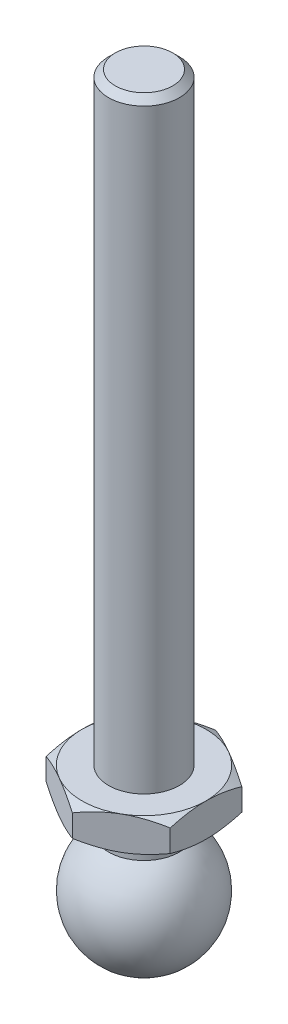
ISO-10303-21;
HEADER;
FILE_DESCRIPTION(('STEP AP214'),'2;1');
FILE_NAME('part.step','',(''),(''),'','','');
FILE_SCHEMA(('AUTOMOTIVE_DESIGN { 1 0 10303 214 1 1 1 1 }'));
ENDSEC;
DATA;
#1=APPLICATION_CONTEXT('core data for automotive mechanical design processes');
#2=APPLICATION_PROTOCOL_DEFINITION('international standard','automotive_design',2000,#1);
#3=PRODUCT_CONTEXT('',#1,'mechanical');
#4=PRODUCT('Part','Part','',(#3));
#5=PRODUCT_RELATED_PRODUCT_CATEGORY('part','',(#4));
#6=PRODUCT_DEFINITION_FORMATION('','',#4);
#7=PRODUCT_DEFINITION_CONTEXT('part definition',#1,'design');
#8=PRODUCT_DEFINITION('design','',#6,#7);
#9=PRODUCT_DEFINITION_SHAPE('','',#8);
#10=(LENGTH_UNIT() NAMED_UNIT(*) SI_UNIT(.MILLI.,.METRE.));
#11=(NAMED_UNIT(*) PLANE_ANGLE_UNIT() SI_UNIT($,.RADIAN.));
#12=(NAMED_UNIT(*) SI_UNIT($,.STERADIAN.) SOLID_ANGLE_UNIT());
#13=UNCERTAINTY_MEASURE_WITH_UNIT(LENGTH_MEASURE(1.E-05),#10,'distance_accuracy_value','');
#14=(GEOMETRIC_REPRESENTATION_CONTEXT(3) GLOBAL_UNCERTAINTY_ASSIGNED_CONTEXT((#13)) GLOBAL_UNIT_ASSIGNED_CONTEXT((#10,
#11,#12)) REPRESENTATION_CONTEXT('',''));
#15=CARTESIAN_POINT('',(0.,0.,0.));
#16=DIRECTION('',(0.,0.,1.));
#17=DIRECTION('',(1.,0.,0.));
#18=AXIS2_PLACEMENT_3D('',#15,#16,#17);
#19=CARTESIAN_POINT('',(0.,12.25,0.));
#20=DIRECTION('',(0.,-1.,0.));
#21=DIRECTION('',(0.,0.,-1.));
#22=AXIS2_PLACEMENT_3D('',#19,#20,#21);
#23=CONICAL_SURFACE('',#22,7.,1.0471975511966);
#24=CARTESIAN_POINT('',(-7.,8.18828268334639,12.1648696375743));
#25=CARTESIAN_POINT('',(-7.,8.33391573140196,11.8738003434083));
#26=CARTESIAN_POINT('',(-7.,8.47854589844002,11.5822239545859));
#27=CARTESIAN_POINT('',(-7.,8.76531569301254,10.997825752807));
#28=CARTESIAN_POINT('',(-7.,8.90745515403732,10.7050038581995));
#29=CARTESIAN_POINT('',(-7.,9.18902214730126,10.117331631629));
#30=CARTESIAN_POINT('',(-7.,9.32844364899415,9.82247840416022));
#31=CARTESIAN_POINT('',(-7.,9.60360604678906,9.23106328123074));
#32=CARTESIAN_POINT('',(-7.,9.73934701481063,8.93450141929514));
#33=CARTESIAN_POINT('',(-7.,10.0123110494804,8.32593520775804));
#34=CARTESIAN_POINT('',(-7.,10.149325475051,8.01383696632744));
#35=CARTESIAN_POINT('',(-7.,10.4171383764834,7.38695797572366));
#36=CARTESIAN_POINT('',(-7.,10.5479365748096,7.07217710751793));
#37=CARTESIAN_POINT('',(-7.,10.8015530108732,6.43962449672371));
#38=CARTESIAN_POINT('',(-7.,10.924376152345,6.1218547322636));
#39=CARTESIAN_POINT('',(-7.,11.1599016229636,5.48260317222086));
#40=CARTESIAN_POINT('',(-7.,11.2726050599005,5.1611217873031));
#41=CARTESIAN_POINT('',(-7.,11.5099014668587,4.4382173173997));
#42=CARTESIAN_POINT('',(-7.,11.6311181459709,4.03566892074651));
#43=CARTESIAN_POINT('',(-7.,11.8469740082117,3.22331060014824));
#44=CARTESIAN_POINT('',(-7.,11.9416155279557,2.81350131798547));
#45=CARTESIAN_POINT('',(-7.,12.0569999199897,2.19742561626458));
#46=CARTESIAN_POINT('',(-7.,12.0908518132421,1.99359214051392));
#47=CARTESIAN_POINT('',(-7.,12.1493191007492,1.5846161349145));
#48=CARTESIAN_POINT('',(-7.,12.1739358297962,1.37947379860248));
#49=CARTESIAN_POINT('',(-7.,12.2131968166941,0.968289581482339));
#50=CARTESIAN_POINT('',(-7.,12.2278439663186,0.762247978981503));
#51=CARTESIAN_POINT('',(-7.,12.2467021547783,0.349683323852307));
#52=CARTESIAN_POINT('',(-7.,12.2509132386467,0.143160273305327));
#53=CARTESIAN_POINT('',(-7.,12.2487493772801,-0.271082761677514));
#54=CARTESIAN_POINT('',(-7.,12.2423100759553,-0.478802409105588));
#55=CARTESIAN_POINT('',(-7.,12.2189433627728,-0.893645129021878));
#56=CARTESIAN_POINT('',(-7.,12.2020159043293,-1.10076819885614));
#57=CARTESIAN_POINT('',(-7.,12.1582124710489,-1.51403043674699));
#58=CARTESIAN_POINT('',(-7.,12.1313327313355,-1.72016920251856));
#59=CARTESIAN_POINT('',(-7.,12.0684180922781,-2.13103319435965));
#60=CARTESIAN_POINT('',(-7.,12.0323828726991,-2.33575837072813));
#61=CARTESIAN_POINT('',(-7.,11.9105686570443,-2.95437912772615));
#62=CARTESIAN_POINT('',(-7.,11.8118729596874,-3.36575077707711));
#63=CARTESIAN_POINT('',(-7.,11.5884533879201,-4.18138012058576));
#64=CARTESIAN_POINT('',(-7.,11.4637148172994,-4.58563365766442));
#65=CARTESIAN_POINT('',(-7.,11.2233248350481,-5.3032089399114));
#66=CARTESIAN_POINT('',(-7.,11.1112875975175,-5.61775957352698));
#67=CARTESIAN_POINT('',(-7.,10.8778514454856,-6.2432502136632));
#68=CARTESIAN_POINT('',(-7.,10.7564551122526,-6.55419118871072));
#69=CARTESIAN_POINT('',(-7.,10.5062070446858,-7.17328528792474));
#70=CARTESIAN_POINT('',(-7.,10.3773503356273,-7.48143638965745));
#71=CARTESIAN_POINT('',(-7.,10.1137823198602,-8.09523802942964));
#72=CARTESIAN_POINT('',(-7.,9.97907065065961,-8.40088841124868));
#73=CARTESIAN_POINT('',(-7.,9.71078407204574,-8.99716345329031));
#74=CARTESIAN_POINT('',(-7.,9.57740317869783,-9.28787568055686));
#75=CARTESIAN_POINT('',(-7.,9.30714715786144,-9.86766295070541));
#76=CARTESIAN_POINT('',(-7.,9.17027208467,-10.1567380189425));
#77=CARTESIAN_POINT('',(-7.,8.89389786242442,-10.7329937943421));
#78=CARTESIAN_POINT('',(-7.,8.75440383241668,-11.0201769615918));
#79=CARTESIAN_POINT('',(-7.,8.47302286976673,-11.5933594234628));
#80=CARTESIAN_POINT('',(-7.,8.3311360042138,-11.879358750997));
#81=CARTESIAN_POINT('',(-7.,8.18828268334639,-12.1648696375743));
#82=B_SPLINE_CURVE_WITH_KNOTS('',3,(#24,#25,#26,#27,#28,#29,#30,#31,#32,#33,#34,#35,#36,#37,#38,
#39,#40,#41,#42,#43,#44,#45,#46,#47,#48,#49,#50,#51,#52,#53,#54,#55,#56,#57,#58,#59,#60,#61,#62,
#63,#64,#65,#66,#67,#68,#69,#70,#71,#72,#73,#74,#75,#76,#77,#78,#79,#80,#81),.UNSPECIFIED.,.F.,
.F.,(4,2,2,2,2,2,2,2,2,2,2,2,2,2,2,2,2,2,2,2,2,2,2,2,2,2,2,2,4),(0.,0.976413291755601,
1.95289161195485,2.93133423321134,3.90975772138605,4.93225217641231,5.95479223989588,
6.97669748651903,7.99849072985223,9.25906449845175,10.5195273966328,11.1392271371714,
11.7588372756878,12.3782676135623,12.9976952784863,13.6208795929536,14.2440666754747,
14.8674897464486,15.4909346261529,16.7587972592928,18.0273773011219,19.0289263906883,
20.0302002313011,21.0321496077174,22.0341611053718,22.9936838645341,23.9531917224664,
24.9109871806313,25.8687558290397),.UNSPECIFIED.);
#83=CARTESIAN_POINT('',(-7.,11.6247852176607,4.04145188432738));
#84=VERTEX_POINT('',#83);
#85=CARTESIAN_POINT('',(-7.,12.25,0.));
#86=VERTEX_POINT('',#85);
#87=EDGE_CURVE('E309',#84,#86,#82,.T.);
#88=ORIENTED_EDGE('',*,*,#87,.F.);
#89=CARTESIAN_POINT('',(0.0002,11.6247185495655,8.0830192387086));
#90=CARTESIAN_POINT('',(-0.153667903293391,11.6760001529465,7.99418356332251));
#91=CARTESIAN_POINT('',(-0.308109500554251,11.7249544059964,7.90501666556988));
#92=CARTESIAN_POINT('',(-0.618246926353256,11.8175672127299,7.72595873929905));
#93=CARTESIAN_POINT('',(-0.773943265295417,11.8612234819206,7.63606741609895));
#94=CARTESIAN_POINT('',(-1.24352516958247,11.9833884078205,7.36495417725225));
#95=CARTESIAN_POINT('',(-1.5592643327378,12.052874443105,7.18266208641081));
#96=CARTESIAN_POINT('',(-2.03176224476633,12.1343550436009,6.9098652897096));
#97=CARTESIAN_POINT('',(-2.18710922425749,12.1575665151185,6.82017566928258));
#98=CARTESIAN_POINT('',(-2.49850511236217,12.1964887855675,6.64039116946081));
#99=CARTESIAN_POINT('',(-2.65455395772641,12.2122002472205,6.55029632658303));
#100=CARTESIAN_POINT('',(-2.96692267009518,12.2357220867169,6.3699501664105));
#101=CARTESIAN_POINT('',(-3.12324202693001,12.2435414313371,6.27969914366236));
#102=CARTESIAN_POINT('',(-3.43601650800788,12.2511197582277,6.09911871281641));
#103=CARTESIAN_POINT('',(-3.59247162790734,12.250878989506,6.00878930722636));
#104=CARTESIAN_POINT('',(-4.02110687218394,12.2391402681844,5.76131663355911));
#105=CARTESIAN_POINT('',(-4.2931466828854,12.2194342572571,5.60425437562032));
#106=CARTESIAN_POINT('',(-4.8354194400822,12.1569465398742,5.29117305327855));
#107=CARTESIAN_POINT('',(-5.10565047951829,12.114143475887,5.13515508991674));
#108=CARTESIAN_POINT('',(-5.64901454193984,12.0071483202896,4.82144370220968));
#109=CARTESIAN_POINT('',(-5.92207900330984,11.9425029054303,4.66378986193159));
#110=CARTESIAN_POINT('',(-6.46413578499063,11.795783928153,4.35083323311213));
#111=CARTESIAN_POINT('',(-6.73313504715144,11.7137448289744,4.19552643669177));
#112=CARTESIAN_POINT('',(-7.0002,11.6247185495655,4.04133641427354));
#113=B_SPLINE_CURVE_WITH_KNOTS('',3,(#89,#90,#91,#92,#93,#94,#95,#96,#97,#98,#99,#100,#101,#102,
#103,#104,#105,#106,#107,#108,#109,#110,#111,#112),.UNSPECIFIED.,.F.,.F.,(4,2,2,2,2,2,2,2,2,2,2,
4),(0.,0.554727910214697,1.10969417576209,2.2219327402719,2.76443041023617,3.30688013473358,
3.84871284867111,4.3905288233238,5.33376515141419,6.27787517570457,7.2429241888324,
8.20607866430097),.UNSPECIFIED.);
#114=CARTESIAN_POINT('',(-3.5,12.25,6.06217782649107));
#115=VERTEX_POINT('',#114);
#116=EDGE_CURVE('E135',#115,#84,#113,.T.);
#117=ORIENTED_EDGE('',*,*,#116,.F.);
#118=CARTESIAN_POINT('',(0.,12.25,0.));
#119=DIRECTION('',(0.,-1.,0.));
#120=DIRECTION('',(0.,0.,-1.));
#121=AXIS2_PLACEMENT_3D('',#118,#119,#120);
#122=CIRCLE('',#121,7.);
#123=EDGE_CURVE('E283',#115,#86,#122,.T.);
#124=ORIENTED_EDGE('',*,*,#123,.T.);
#125=EDGE_LOOP('',(#88,#117,#124));
#126=FACE_BOUND('',#125,.T.);
#127=ADVANCED_FACE('F14',(#126),#23,.T.);
#128=CARTESIAN_POINT('',(-7.,11.6247852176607,-4.04145188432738));
#129=VERTEX_POINT('',#128);
#130=EDGE_CURVE('E193',#86,#129,#82,.T.);
#131=ORIENTED_EDGE('',*,*,#130,.F.);
#132=CARTESIAN_POINT('',(-3.5,12.25,-6.06217782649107));
#133=VERTEX_POINT('',#132);
#134=EDGE_CURVE('E195',#86,#133,#122,.T.);
#135=ORIENTED_EDGE('',*,*,#134,.T.);
#136=CARTESIAN_POINT('',(-7.0002,11.6247185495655,-4.04133641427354));
#137=CARTESIAN_POINT('',(-6.84633209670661,11.6760001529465,-4.13017208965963));
#138=CARTESIAN_POINT('',(-6.69189049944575,11.7249544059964,-4.21933898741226));
#139=CARTESIAN_POINT('',(-6.38175307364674,11.8175672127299,-4.39839691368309));
#140=CARTESIAN_POINT('',(-6.22605673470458,11.8612234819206,-4.48828823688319));
#141=CARTESIAN_POINT('',(-5.75647483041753,11.9833884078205,-4.75940147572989));
#142=CARTESIAN_POINT('',(-5.44073566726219,12.052874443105,-4.94169356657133));
#143=CARTESIAN_POINT('',(-4.96823775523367,12.1343550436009,-5.21449036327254));
#144=CARTESIAN_POINT('',(-4.81289077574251,12.1575665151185,-5.30417998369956));
#145=CARTESIAN_POINT('',(-4.50149488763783,12.1964887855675,-5.48396448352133));
#146=CARTESIAN_POINT('',(-4.34544604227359,12.2122002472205,-5.57405932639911));
#147=CARTESIAN_POINT('',(-4.03307732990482,12.2357220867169,-5.75440548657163));
#148=CARTESIAN_POINT('',(-3.87675797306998,12.2435414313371,-5.84465650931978));
#149=CARTESIAN_POINT('',(-3.56398349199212,12.2511197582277,-6.02523694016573));
#150=CARTESIAN_POINT('',(-3.40752837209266,12.250878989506,-6.11556634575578));
#151=CARTESIAN_POINT('',(-2.97889312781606,12.2391402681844,-6.36303901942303));
#152=CARTESIAN_POINT('',(-2.70685331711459,12.2194342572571,-6.52010127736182));
#153=CARTESIAN_POINT('',(-2.1645805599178,12.1569465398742,-6.83318259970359));
#154=CARTESIAN_POINT('',(-1.89434952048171,12.114143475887,-6.9892005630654));
#155=CARTESIAN_POINT('',(-1.35098545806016,12.0071483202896,-7.30291195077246));
#156=CARTESIAN_POINT('',(-1.07792099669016,11.9425029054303,-7.46056579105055));
#157=CARTESIAN_POINT('',(-0.535864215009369,11.795783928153,-7.77352241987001));
#158=CARTESIAN_POINT('',(-0.266864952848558,11.7137448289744,-7.92882921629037));
#159=CARTESIAN_POINT('',(0.000199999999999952,11.6247185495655,-8.0830192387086));
#160=B_SPLINE_CURVE_WITH_KNOTS('',3,(#136,#137,#138,#139,#140,#141,#142,#143,#144,#145,#146,
#147,#148,#149,#150,#151,#152,#153,#154,#155,#156,#157,#158,#159),.UNSPECIFIED.,.F.,.F.,(4,2,2,
2,2,2,2,2,2,2,2,4),(0.,0.554727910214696,1.10969417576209,2.2219327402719,2.76443041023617,
3.30688013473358,3.8487128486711,4.3905288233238,5.33376515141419,6.27787517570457,
7.2429241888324,8.20607866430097),.UNSPECIFIED.);
#161=EDGE_CURVE('E183',#129,#133,#160,.T.);
#162=ORIENTED_EDGE('',*,*,#161,.F.);
#163=EDGE_LOOP('',(#131,#135,#162));
#164=FACE_BOUND('',#163,.T.);
#165=ADVANCED_FACE('F192',(#164),#23,.T.);
#166=CARTESIAN_POINT('',(0.,11.6247852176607,-8.08290376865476));
#167=VERTEX_POINT('',#166);
#168=EDGE_CURVE('E197',#133,#167,#160,.T.);
#169=ORIENTED_EDGE('',*,*,#168,.F.);
#170=CARTESIAN_POINT('',(3.5,12.25,-6.06217782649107));
#171=VERTEX_POINT('',#170);
#172=EDGE_CURVE('E293',#133,#171,#122,.T.);
#173=ORIENTED_EDGE('',*,*,#172,.T.);
#174=CARTESIAN_POINT('',(-0.0002,11.6247185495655,-8.0830192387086));
#175=CARTESIAN_POINT('',(0.153667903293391,11.6760001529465,-7.99418356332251));
#176=CARTESIAN_POINT('',(0.308109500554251,11.7249544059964,-7.90501666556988));
#177=CARTESIAN_POINT('',(0.618246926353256,11.8175672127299,-7.72595873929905));
#178=CARTESIAN_POINT('',(0.773943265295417,11.8612234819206,-7.63606741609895));
#179=CARTESIAN_POINT('',(1.24352516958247,11.9833884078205,-7.36495417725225));
#180=CARTESIAN_POINT('',(1.5592643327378,12.052874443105,-7.18266208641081));
#181=CARTESIAN_POINT('',(2.03176224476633,12.1343550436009,-6.9098652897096));
#182=CARTESIAN_POINT('',(2.18710922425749,12.1575665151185,-6.82017566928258));
#183=CARTESIAN_POINT('',(2.49850511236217,12.1964887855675,-6.64039116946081));
#184=CARTESIAN_POINT('',(2.65455395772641,12.2122002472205,-6.55029632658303));
#185=CARTESIAN_POINT('',(2.96692267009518,12.2357220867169,-6.3699501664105));
#186=CARTESIAN_POINT('',(3.12324202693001,12.2435414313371,-6.27969914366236));
#187=CARTESIAN_POINT('',(3.43601650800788,12.2511197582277,-6.09911871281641));
#188=CARTESIAN_POINT('',(3.59247162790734,12.250878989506,-6.00878930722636));
#189=CARTESIAN_POINT('',(4.02110687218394,12.2391402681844,-5.76131663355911));
#190=CARTESIAN_POINT('',(4.2931466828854,12.2194342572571,-5.60425437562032));
#191=CARTESIAN_POINT('',(4.8354194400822,12.1569465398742,-5.29117305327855));
#192=CARTESIAN_POINT('',(5.10565047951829,12.114143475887,-5.13515508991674));
#193=CARTESIAN_POINT('',(5.64901454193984,12.0071483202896,-4.82144370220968));
#194=CARTESIAN_POINT('',(5.92207900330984,11.9425029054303,-4.66378986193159));
#195=CARTESIAN_POINT('',(6.46413578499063,11.795783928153,-4.35083323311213));
#196=CARTESIAN_POINT('',(6.73313504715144,11.7137448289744,-4.19552643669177));
#197=CARTESIAN_POINT('',(7.0002,11.6247185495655,-4.04133641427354));
#198=B_SPLINE_CURVE_WITH_KNOTS('',3,(#174,#175,#176,#177,#178,#179,#180,#181,#182,#183,#184,
#185,#186,#187,#188,#189,#190,#191,#192,#193,#194,#195,#196,#197),.UNSPECIFIED.,.F.,.F.,(4,2,2,
2,2,2,2,2,2,2,2,4),(0.,0.554727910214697,1.10969417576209,2.2219327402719,2.76443041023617,
3.30688013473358,3.84871284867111,4.3905288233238,5.33376515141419,6.27787517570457,
7.2429241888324,8.20607866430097),.UNSPECIFIED.);
#199=EDGE_CURVE('E243',#167,#171,#198,.T.);
#200=ORIENTED_EDGE('',*,*,#199,.F.);
#201=EDGE_LOOP('',(#169,#173,#200));
#202=FACE_BOUND('',#201,.T.);
#203=ADVANCED_FACE('F342',(#202),#23,.T.);
#204=CARTESIAN_POINT('',(7.,11.6247852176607,-4.04145188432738));
#205=VERTEX_POINT('',#204);
#206=EDGE_CURVE('E238',#171,#205,#198,.T.);
#207=ORIENTED_EDGE('',*,*,#206,.F.);
#208=CARTESIAN_POINT('',(7.,12.25,0.));
#209=VERTEX_POINT('',#208);
#210=EDGE_CURVE('E288',#171,#209,#122,.T.);
#211=ORIENTED_EDGE('',*,*,#210,.T.);
#212=CARTESIAN_POINT('',(7.,8.18828268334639,-12.1648696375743));
#213=CARTESIAN_POINT('',(7.,8.33391573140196,-11.8738003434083));
#214=CARTESIAN_POINT('',(7.,8.47854589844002,-11.5822239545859));
#215=CARTESIAN_POINT('',(7.,8.76531569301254,-10.997825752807));
#216=CARTESIAN_POINT('',(7.,8.90745515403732,-10.7050038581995));
#217=CARTESIAN_POINT('',(7.,9.18902214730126,-10.117331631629));
#218=CARTESIAN_POINT('',(7.,9.32844364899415,-9.82247840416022));
#219=CARTESIAN_POINT('',(7.,9.60360604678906,-9.23106328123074));
#220=CARTESIAN_POINT('',(7.,9.73934701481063,-8.93450141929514));
#221=CARTESIAN_POINT('',(7.,10.0123110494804,-8.32593520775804));
#222=CARTESIAN_POINT('',(7.,10.149325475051,-8.01383696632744));
#223=CARTESIAN_POINT('',(7.,10.4171383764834,-7.38695797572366));
#224=CARTESIAN_POINT('',(7.,10.5479365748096,-7.07217710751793));
#225=CARTESIAN_POINT('',(7.,10.8015530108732,-6.43962449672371));
#226=CARTESIAN_POINT('',(7.,10.924376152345,-6.1218547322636));
#227=CARTESIAN_POINT('',(7.,11.1599016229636,-5.48260317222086));
#228=CARTESIAN_POINT('',(7.,11.2726050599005,-5.1611217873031));
#229=CARTESIAN_POINT('',(7.,11.5099014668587,-4.4382173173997));
#230=CARTESIAN_POINT('',(7.,11.6311181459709,-4.03566892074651));
#231=CARTESIAN_POINT('',(7.,11.8469740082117,-3.22331060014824));
#232=CARTESIAN_POINT('',(7.,11.9416155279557,-2.81350131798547));
#233=CARTESIAN_POINT('',(7.,12.0569999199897,-2.19742561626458));
#234=CARTESIAN_POINT('',(7.,12.0908518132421,-1.99359214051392));
#235=CARTESIAN_POINT('',(7.,12.1493191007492,-1.5846161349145));
#236=CARTESIAN_POINT('',(7.,12.1739358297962,-1.37947379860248));
#237=CARTESIAN_POINT('',(7.,12.2131968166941,-0.968289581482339));
#238=CARTESIAN_POINT('',(7.,12.2278439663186,-0.762247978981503));
#239=CARTESIAN_POINT('',(7.,12.2467021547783,-0.349683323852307));
#240=CARTESIAN_POINT('',(7.,12.2509132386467,-0.143160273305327));
#241=CARTESIAN_POINT('',(7.,12.2487493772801,0.271082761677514));
#242=CARTESIAN_POINT('',(7.,12.2423100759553,0.478802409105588));
#243=CARTESIAN_POINT('',(7.,12.2189433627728,0.893645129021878));
#244=CARTESIAN_POINT('',(7.,12.2020159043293,1.10076819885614));
#245=CARTESIAN_POINT('',(7.,12.1582124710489,1.51403043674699));
#246=CARTESIAN_POINT('',(7.,12.1313327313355,1.72016920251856));
#247=CARTESIAN_POINT('',(7.,12.0684180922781,2.13103319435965));
#248=CARTESIAN_POINT('',(7.,12.0323828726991,2.33575837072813));
#249=CARTESIAN_POINT('',(7.,11.9105686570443,2.95437912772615));
#250=CARTESIAN_POINT('',(7.,11.8118729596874,3.36575077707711));
#251=CARTESIAN_POINT('',(7.,11.5884533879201,4.18138012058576));
#252=CARTESIAN_POINT('',(7.,11.4637148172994,4.58563365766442));
#253=CARTESIAN_POINT('',(7.,11.2233248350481,5.3032089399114));
#254=CARTESIAN_POINT('',(7.,11.1112875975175,5.61775957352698));
#255=CARTESIAN_POINT('',(7.,10.8778514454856,6.2432502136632));
#256=CARTESIAN_POINT('',(7.,10.7564551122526,6.55419118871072));
#257=CARTESIAN_POINT('',(7.,10.5062070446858,7.17328528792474));
#258=CARTESIAN_POINT('',(7.,10.3773503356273,7.48143638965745));
#259=CARTESIAN_POINT('',(7.,10.1137823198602,8.09523802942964));
#260=CARTESIAN_POINT('',(7.,9.97907065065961,8.40088841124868));
#261=CARTESIAN_POINT('',(7.,9.71078407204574,8.99716345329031));
#262=CARTESIAN_POINT('',(7.,9.57740317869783,9.28787568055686));
#263=CARTESIAN_POINT('',(7.,9.30714715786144,9.86766295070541));
#264=CARTESIAN_POINT('',(7.,9.17027208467,10.1567380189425));
#265=CARTESIAN_POINT('',(7.,8.89389786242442,10.7329937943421));
#266=CARTESIAN_POINT('',(7.,8.75440383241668,11.0201769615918));
#267=CARTESIAN_POINT('',(7.,8.47302286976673,11.5933594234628));
#268=CARTESIAN_POINT('',(7.,8.3311360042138,11.879358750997));
#269=CARTESIAN_POINT('',(7.,8.18828268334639,12.1648696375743));
#270=B_SPLINE_CURVE_WITH_KNOTS('',3,(#212,#213,#214,#215,#216,#217,#218,#219,#220,#221,#222,
#223,#224,#225,#226,#227,#228,#229,#230,#231,#232,#233,#234,#235,#236,#237,#238,#239,#240,#241,
#242,#243,#244,#245,#246,#247,#248,#249,#250,#251,#252,#253,#254,#255,#256,#257,#258,#259,#260,
#261,#262,#263,#264,#265,#266,#267,#268,#269),.UNSPECIFIED.,.F.,.F.,(4,2,2,2,2,2,2,2,2,2,2,2,2,
2,2,2,2,2,2,2,2,2,2,2,2,2,2,2,4),(0.,0.976413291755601,1.95289161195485,2.93133423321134,
3.90975772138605,4.93225217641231,5.95479223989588,6.97669748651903,7.99849072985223,
9.25906449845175,10.5195273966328,11.1392271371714,11.7588372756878,12.3782676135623,
12.9976952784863,13.6208795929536,14.2440666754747,14.8674897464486,15.4909346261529,
16.7587972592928,18.0273773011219,19.0289263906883,20.0302002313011,21.0321496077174,
22.0341611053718,22.9936838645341,23.9531917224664,24.9109871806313,25.8687558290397),.UNSPECIFIED.);
#271=EDGE_CURVE('E249',#205,#209,#270,.T.);
#272=ORIENTED_EDGE('',*,*,#271,.F.);
#273=EDGE_LOOP('',(#207,#211,#272));
#274=FACE_BOUND('',#273,.T.);
#275=ADVANCED_FACE('F352',(#274),#23,.T.);
#276=CARTESIAN_POINT('',(7.,11.6247852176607,4.04145188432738));
#277=VERTEX_POINT('',#276);
#278=EDGE_CURVE('E251',#209,#277,#270,.T.);
#279=ORIENTED_EDGE('',*,*,#278,.F.);
#280=CARTESIAN_POINT('',(3.5,12.25,6.06217782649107));
#281=VERTEX_POINT('',#280);
#282=EDGE_CURVE('E281',#209,#281,#122,.T.);
#283=ORIENTED_EDGE('',*,*,#282,.T.);
#284=CARTESIAN_POINT('',(7.0002,11.6247185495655,4.04133641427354));
#285=CARTESIAN_POINT('',(6.84633209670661,11.6760001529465,4.13017208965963));
#286=CARTESIAN_POINT('',(6.69189049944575,11.7249544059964,4.21933898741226));
#287=CARTESIAN_POINT('',(6.38175307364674,11.8175672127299,4.39839691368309));
#288=CARTESIAN_POINT('',(6.22605673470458,11.8612234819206,4.48828823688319));
#289=CARTESIAN_POINT('',(5.75647483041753,11.9833884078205,4.75940147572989));
#290=CARTESIAN_POINT('',(5.44073566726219,12.052874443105,4.94169356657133));
#291=CARTESIAN_POINT('',(4.96823775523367,12.1343550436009,5.21449036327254));
#292=CARTESIAN_POINT('',(4.81289077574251,12.1575665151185,5.30417998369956));
#293=CARTESIAN_POINT('',(4.50149488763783,12.1964887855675,5.48396448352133));
#294=CARTESIAN_POINT('',(4.34544604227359,12.2122002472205,5.57405932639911));
#295=CARTESIAN_POINT('',(4.03307732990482,12.2357220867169,5.75440548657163));
#296=CARTESIAN_POINT('',(3.87675797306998,12.2435414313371,5.84465650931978));
#297=CARTESIAN_POINT('',(3.56398349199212,12.2511197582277,6.02523694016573));
#298=CARTESIAN_POINT('',(3.40752837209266,12.250878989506,6.11556634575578));
#299=CARTESIAN_POINT('',(2.97889312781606,12.2391402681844,6.36303901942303));
#300=CARTESIAN_POINT('',(2.70685331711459,12.2194342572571,6.52010127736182));
#301=CARTESIAN_POINT('',(2.1645805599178,12.1569465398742,6.83318259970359));
#302=CARTESIAN_POINT('',(1.89434952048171,12.114143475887,6.9892005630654));
#303=CARTESIAN_POINT('',(1.35098545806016,12.0071483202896,7.30291195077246));
#304=CARTESIAN_POINT('',(1.07792099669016,11.9425029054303,7.46056579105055));
#305=CARTESIAN_POINT('',(0.535864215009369,11.795783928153,7.77352241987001));
#306=CARTESIAN_POINT('',(0.266864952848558,11.7137448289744,7.92882921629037));
#307=CARTESIAN_POINT('',(-0.000199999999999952,11.6247185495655,8.0830192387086));
#308=B_SPLINE_CURVE_WITH_KNOTS('',3,(#284,#285,#286,#287,#288,#289,#290,#291,#292,#293,#294,
#295,#296,#297,#298,#299,#300,#301,#302,#303,#304,#305,#306,#307),.UNSPECIFIED.,.F.,.F.,(4,2,2,
2,2,2,2,2,2,2,2,4),(0.,0.554727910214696,1.10969417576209,2.2219327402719,2.76443041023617,
3.30688013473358,3.8487128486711,4.3905288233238,5.33376515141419,6.27787517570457,
7.2429241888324,8.20607866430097),.UNSPECIFIED.);
#309=EDGE_CURVE('E126',#277,#281,#308,.T.);
#310=ORIENTED_EDGE('',*,*,#309,.F.);
#311=EDGE_LOOP('',(#279,#283,#310));
#312=FACE_BOUND('',#311,.T.);
#313=ADVANCED_FACE('F285',(#312),#23,.T.);
#314=CARTESIAN_POINT('',(0.,11.6247852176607,8.08290376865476));
#315=VERTEX_POINT('',#314);
#316=EDGE_CURVE('E116',#281,#315,#308,.T.);
#317=ORIENTED_EDGE('',*,*,#316,.F.);
#318=EDGE_CURVE('E274',#281,#115,#122,.T.);
#319=ORIENTED_EDGE('',*,*,#318,.T.);
#320=EDGE_CURVE('E29',#315,#115,#113,.T.);
#321=ORIENTED_EDGE('',*,*,#320,.F.);
#322=EDGE_LOOP('',(#317,#319,#321));
#323=FACE_BOUND('',#322,.T.);
#324=ADVANCED_FACE('F273',(#323),#23,.T.);
#325=CARTESIAN_POINT('',(0.,80.25,0.));
#326=DIRECTION('',(0.,-1.,0.));
#327=DIRECTION('',(0.,0.,-1.));
#328=AXIS2_PLACEMENT_3D('',#325,#326,#327);
#329=PLANE('',#328);
#330=CARTESIAN_POINT('',(0.,80.25,0.));
#331=DIRECTION('',(0.,-1.,0.));
#332=DIRECTION('',(0.,0.,-1.));
#333=AXIS2_PLACEMENT_3D('',#330,#331,#332);
#334=CIRCLE('',#333,3.233);
#335=CARTESIAN_POINT('',(0.,80.25,-3.233));
#336=VERTEX_POINT('',#335);
#337=EDGE_CURVE('E22',#336,#336,#334,.T.);
#338=ORIENTED_EDGE('',*,*,#337,.F.);
#339=EDGE_LOOP('',(#338));
#340=FACE_BOUND('',#339,.T.);
#341=ADVANCED_FACE('F16',(#340),#329,.F.);
#342=CARTESIAN_POINT('',(0.,80.25,0.));
#343=DIRECTION('',(0.,-1.,0.));
#344=DIRECTION('',(0.,0.,-1.));
#345=AXIS2_PLACEMENT_3D('',#342,#343,#344);
#346=CONICAL_SURFACE('',#345,3.233,0.785398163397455);
#347=CARTESIAN_POINT('',(0.,79.483,0.));
#348=DIRECTION('',(0.,-1.,0.));
#349=DIRECTION('',(0.,0.,-1.));
#350=AXIS2_PLACEMENT_3D('',#347,#348,#349);
#351=CIRCLE('',#350,4.);
#352=CARTESIAN_POINT('',(0.,79.483,-4.));
#353=VERTEX_POINT('',#352);
#354=EDGE_CURVE('E290',#353,#353,#351,.T.);
#355=ORIENTED_EDGE('',*,*,#354,.F.);
#356=EDGE_LOOP('',(#355));
#357=FACE_BOUND('',#356,.T.);
#358=ORIENTED_EDGE('',*,*,#337,.T.);
#359=EDGE_LOOP('',(#358));
#360=FACE_BOUND('',#359,.T.);
#361=ADVANCED_FACE('F350',(#357,#360),#346,.T.);
#362=CARTESIAN_POINT('',(0.,-7.,0.));
#363=DIRECTION('',(0.,-1.,0.));
#364=DIRECTION('',(0.,0.,-1.));
#365=AXIS2_PLACEMENT_3D('',#362,#363,#364);
#366=CYLINDRICAL_SURFACE('',#365,4.);
#367=CARTESIAN_POINT('',(0.,12.25,0.));
#368=DIRECTION('',(0.,-1.,0.));
#369=DIRECTION('',(0.,0.,-1.));
#370=AXIS2_PLACEMENT_3D('',#367,#368,#369);
#371=CIRCLE('',#370,4.);
#372=CARTESIAN_POINT('',(0.,12.25,-4.));
#373=VERTEX_POINT('',#372);
#374=EDGE_CURVE('E287',#373,#373,#371,.T.);
#375=ORIENTED_EDGE('',*,*,#374,.F.);
#376=EDGE_LOOP('',(#375));
#377=FACE_BOUND('',#376,.T.);
#378=ORIENTED_EDGE('',*,*,#354,.T.);
#379=EDGE_LOOP('',(#378));
#380=FACE_BOUND('',#379,.T.);
#381=ADVANCED_FACE('F427',(#377,#380),#366,.T.);
#382=CARTESIAN_POINT('',(4.,12.25,0.));
#383=DIRECTION('',(0.,-1.,0.));
#384=DIRECTION('',(0.,0.,-1.));
#385=AXIS2_PLACEMENT_3D('',#382,#383,#384);
#386=PLANE('',#385);
#387=ORIENTED_EDGE('',*,*,#282,.F.);
#388=ORIENTED_EDGE('',*,*,#210,.F.);
#389=ORIENTED_EDGE('',*,*,#172,.F.);
#390=ORIENTED_EDGE('',*,*,#134,.F.);
#391=ORIENTED_EDGE('',*,*,#123,.F.);
#392=ORIENTED_EDGE('',*,*,#318,.F.);
#393=EDGE_LOOP('',(#387,#388,#389,#390,#391,#392));
#394=FACE_BOUND('',#393,.T.);
#395=ORIENTED_EDGE('',*,*,#374,.T.);
#396=EDGE_LOOP('',(#395));
#397=FACE_BOUND('',#396,.T.);
#398=ADVANCED_FACE('F278',(#394,#397),#386,.F.);
#399=CARTESIAN_POINT('',(-7.,8.5,-4.04145188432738));
#400=DIRECTION('',(-1.,0.,0.));
#401=DIRECTION('',(0.,0.,1.));
#402=AXIS2_PLACEMENT_3D('',#399,#400,#401);
#403=PLANE('',#402);
#404=ORIENTED_EDGE('',*,*,#87,.T.);
#405=ORIENTED_EDGE('',*,*,#130,.T.);
#406=DIRECTION('',(0.,1.,0.));
#407=VECTOR('',#406,1.);
#408=CARTESIAN_POINT('',(-7.,8.5,-4.04145188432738));
#409=LINE('',#408,#407);
#410=CARTESIAN_POINT('',(-7.,9.12521478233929,-4.04145188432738));
#411=VERTEX_POINT('',#410);
#412=EDGE_CURVE('E109',#411,#129,#409,.T.);
#413=ORIENTED_EDGE('',*,*,#412,.F.);
#414=CARTESIAN_POINT('',(-7.,12.5617173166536,-12.1648696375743));
#415=CARTESIAN_POINT('',(-7.,12.416084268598,-11.8738003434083));
#416=CARTESIAN_POINT('',(-7.,12.27145410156,-11.5822239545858));
#417=CARTESIAN_POINT('',(-7.,11.9846843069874,-10.997825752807));
#418=CARTESIAN_POINT('',(-7.,11.8425448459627,-10.7050038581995));
#419=CARTESIAN_POINT('',(-7.,11.5609778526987,-10.1173316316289));
#420=CARTESIAN_POINT('',(-7.,11.4215563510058,-9.82247840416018));
#421=CARTESIAN_POINT('',(-7.,11.1463939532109,-9.23106328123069));
#422=CARTESIAN_POINT('',(-7.,11.0106529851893,-8.93450141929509));
#423=CARTESIAN_POINT('',(-7.,10.7376889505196,-8.32593520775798));
#424=CARTESIAN_POINT('',(-7.,10.6006745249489,-8.01383696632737));
#425=CARTESIAN_POINT('',(-7.,10.3328616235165,-7.38695797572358));
#426=CARTESIAN_POINT('',(-7.,10.2020634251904,-7.07217710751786));
#427=CARTESIAN_POINT('',(-7.,9.94844698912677,-6.43962449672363));
#428=CARTESIAN_POINT('',(-7.,9.825623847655,-6.12185473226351));
#429=CARTESIAN_POINT('',(-7.,9.59009837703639,-5.48260317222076));
#430=CARTESIAN_POINT('',(-7.,9.47739494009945,-5.16112178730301));
#431=CARTESIAN_POINT('',(-7.,9.24009853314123,-4.4382173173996));
#432=CARTESIAN_POINT('',(-7.,9.11888185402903,-4.03566892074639));
#433=CARTESIAN_POINT('',(-7.,8.90302599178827,-3.22331060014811));
#434=CARTESIAN_POINT('',(-7.,8.80838447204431,-2.81350131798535));
#435=CARTESIAN_POINT('',(-7.,8.69300008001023,-2.19742561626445));
#436=CARTESIAN_POINT('',(-7.,8.65914818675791,-1.99359214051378));
#437=CARTESIAN_POINT('',(-7.,8.60068089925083,-1.58461613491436));
#438=CARTESIAN_POINT('',(-7.,8.5760641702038,-1.37947379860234));
#439=CARTESIAN_POINT('',(-7.,8.53680318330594,-0.968289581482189));
#440=CARTESIAN_POINT('',(-7.,8.52215603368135,-0.76224797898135));
#441=CARTESIAN_POINT('',(-7.,8.50329784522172,-0.349683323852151));
#442=CARTESIAN_POINT('',(-7.,8.49908676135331,-0.143160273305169));
#443=CARTESIAN_POINT('',(-7.,8.50125062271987,0.271082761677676));
#444=CARTESIAN_POINT('',(-7.,8.50768992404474,0.478802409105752));
#445=CARTESIAN_POINT('',(-7.,8.53105663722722,0.893645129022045));
#446=CARTESIAN_POINT('',(-7.,8.54798409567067,1.1007681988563));
#447=CARTESIAN_POINT('',(-7.,8.59178752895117,1.51403043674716));
#448=CARTESIAN_POINT('',(-7.,8.61866726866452,1.72016920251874));
#449=CARTESIAN_POINT('',(-7.,8.68158190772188,2.13103319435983));
#450=CARTESIAN_POINT('',(-7.,8.71761712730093,2.33575837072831));
#451=CARTESIAN_POINT('',(-7.,8.83943134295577,2.95437912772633));
#452=CARTESIAN_POINT('',(-7.,8.93812704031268,3.3657507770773));
#453=CARTESIAN_POINT('',(-7.,9.16154661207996,4.18138012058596));
#454=CARTESIAN_POINT('',(-7.,9.28628518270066,4.58563365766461));
#455=CARTESIAN_POINT('',(-7.,9.52667516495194,5.30320893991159));
#456=CARTESIAN_POINT('',(-7.,9.63871240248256,5.61775957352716));
#457=CARTESIAN_POINT('',(-7.,9.87214855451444,6.24325021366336));
#458=CARTESIAN_POINT('',(-7.,9.99354488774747,6.55419118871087));
#459=CARTESIAN_POINT('',(-7.,10.2437929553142,7.17328528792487));
#460=CARTESIAN_POINT('',(-7.,10.3726496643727,7.48143638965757));
#461=CARTESIAN_POINT('',(-7.,10.6362176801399,8.09523802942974));
#462=CARTESIAN_POINT('',(-7.,10.7709293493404,8.40088841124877));
#463=CARTESIAN_POINT('',(-7.,11.0392159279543,8.99716345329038));
#464=CARTESIAN_POINT('',(-7.,11.1725968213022,9.28787568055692));
#465=CARTESIAN_POINT('',(-7.,11.4428528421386,9.86766295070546));
#466=CARTESIAN_POINT('',(-7.,11.57972791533,10.1567380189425));
#467=CARTESIAN_POINT('',(-7.,11.8561021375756,10.7329937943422));
#468=CARTESIAN_POINT('',(-7.,11.9955961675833,11.0201769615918));
#469=CARTESIAN_POINT('',(-7.,12.2769771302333,11.5933594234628));
#470=CARTESIAN_POINT('',(-7.,12.4188639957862,11.879358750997));
#471=CARTESIAN_POINT('',(-7.,12.5617173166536,12.1648696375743));
#472=B_SPLINE_CURVE_WITH_KNOTS('',3,(#414,#415,#416,#417,#418,#419,#420,#421,#422,#423,#424,
#425,#426,#427,#428,#429,#430,#431,#432,#433,#434,#435,#436,#437,#438,#439,#440,#441,#442,#443,
#444,#445,#446,#447,#448,#449,#450,#451,#452,#453,#454,#455,#456,#457,#458,#459,#460,#461,#462,
#463,#464,#465,#466,#467,#468,#469,#470,#471),.UNSPECIFIED.,.F.,.F.,(4,2,2,2,2,2,2,2,2,2,2,2,2,
2,2,2,2,2,2,2,2,2,2,2,2,2,2,2,4),(0.,0.976413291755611,1.95289161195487,2.93133423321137,
3.90975772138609,4.93225217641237,5.95479223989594,6.97669748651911,7.99849072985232,
9.25906449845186,10.5195273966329,11.1392271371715,11.7588372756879,12.3782676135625,
12.9976952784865,13.6208795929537,14.2440666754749,14.8674897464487,15.490934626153,
16.758797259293,18.0273773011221,19.0289263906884,20.0302002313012,21.0321496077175,
22.0341611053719,22.9936838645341,23.9531917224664,24.9109871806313,25.8687558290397),.UNSPECIFIED.);
#473=CARTESIAN_POINT('',(-7.,8.5,0.));
#474=VERTEX_POINT('',#473);
#475=EDGE_CURVE('E199',#411,#474,#472,.T.);
#476=ORIENTED_EDGE('',*,*,#475,.T.);
#477=CARTESIAN_POINT('',(-7.,9.12521478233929,4.04145188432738));
#478=VERTEX_POINT('',#477);
#479=EDGE_CURVE('E196',#474,#478,#472,.T.);
#480=ORIENTED_EDGE('',*,*,#479,.T.);
#481=DIRECTION('',(0.,1.,0.));
#482=VECTOR('',#481,1.);
#483=CARTESIAN_POINT('',(-7.,8.5,4.04145188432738));
#484=LINE('',#483,#482);
#485=EDGE_CURVE('E118',#478,#84,#484,.T.);
#486=ORIENTED_EDGE('',*,*,#485,.T.);
#487=EDGE_LOOP('',(#404,#405,#413,#476,#480,#486));
#488=FACE_BOUND('',#487,.T.);
#489=ADVANCED_FACE('F224',(#488),#403,.T.);
#490=CARTESIAN_POINT('',(0.,8.5,-8.08290376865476));
#491=DIRECTION('',(-0.5,0.,-0.866025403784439));
#492=DIRECTION('',(-0.866025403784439,0.,0.5));
#493=AXIS2_PLACEMENT_3D('',#490,#491,#492);
#494=PLANE('',#493);
#495=ORIENTED_EDGE('',*,*,#161,.T.);
#496=ORIENTED_EDGE('',*,*,#168,.T.);
#497=DIRECTION('',(0.,1.,0.));
#498=VECTOR('',#497,1.);
#499=CARTESIAN_POINT('',(0.,8.5,-8.08290376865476));
#500=LINE('',#499,#498);
#501=CARTESIAN_POINT('',(0.,9.12521478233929,-8.08290376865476));
#502=VERTEX_POINT('',#501);
#503=EDGE_CURVE('E175',#502,#167,#500,.T.);
#504=ORIENTED_EDGE('',*,*,#503,.F.);
#505=CARTESIAN_POINT('',(0.0002,9.1252814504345,-8.0830192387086));
#506=CARTESIAN_POINT('',(-0.153667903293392,9.07399984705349,-7.99418356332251));
#507=CARTESIAN_POINT('',(-0.308109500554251,9.02504559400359,-7.90501666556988));
#508=CARTESIAN_POINT('',(-0.618246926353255,8.93243278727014,-7.72595873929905));
#509=CARTESIAN_POINT('',(-0.773943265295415,8.88877651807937,-7.63606741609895));
#510=CARTESIAN_POINT('',(-1.24352516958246,8.7666115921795,-7.36495417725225));
#511=CARTESIAN_POINT('',(-1.5592643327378,8.69712555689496,-7.18266208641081));
#512=CARTESIAN_POINT('',(-2.03176224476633,8.6156449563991,-6.9098652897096));
#513=CARTESIAN_POINT('',(-2.18710922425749,8.59243348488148,-6.82017566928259));
#514=CARTESIAN_POINT('',(-2.49850511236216,8.55351121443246,-6.64039116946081));
#515=CARTESIAN_POINT('',(-2.65455395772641,8.53779975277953,-6.55029632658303));
#516=CARTESIAN_POINT('',(-2.96692267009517,8.51427791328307,-6.36995016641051));
#517=CARTESIAN_POINT('',(-3.12324202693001,8.50645856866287,-6.27969914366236));
#518=CARTESIAN_POINT('',(-3.43601650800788,8.49888024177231,-6.09911871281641));
#519=CARTESIAN_POINT('',(-3.59247162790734,8.49912101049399,-6.00878930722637));
#520=CARTESIAN_POINT('',(-4.02110687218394,8.5108597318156,-5.76131663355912));
#521=CARTESIAN_POINT('',(-4.2931466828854,8.53056574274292,-5.60425437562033));
#522=CARTESIAN_POINT('',(-4.83541944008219,8.59305346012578,-5.29117305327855));
#523=CARTESIAN_POINT('',(-5.10565047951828,8.63585652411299,-5.13515508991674));
#524=CARTESIAN_POINT('',(-5.64901454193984,8.74285167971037,-4.82144370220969));
#525=CARTESIAN_POINT('',(-5.92207900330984,8.80749709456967,-4.66378986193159));
#526=CARTESIAN_POINT('',(-6.46413578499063,8.95421607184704,-4.35083323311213));
#527=CARTESIAN_POINT('',(-6.73313504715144,9.03625517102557,-4.19552643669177));
#528=CARTESIAN_POINT('',(-7.0002,9.1252814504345,-4.04133641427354));
#529=B_SPLINE_CURVE_WITH_KNOTS('',3,(#505,#506,#507,#508,#509,#510,#511,#512,#513,#514,#515,
#516,#517,#518,#519,#520,#521,#522,#523,#524,#525,#526,#527,#528),.UNSPECIFIED.,.F.,.F.,(4,2,2,
2,2,2,2,2,2,2,2,4),(0.,0.554727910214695,1.10969417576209,2.2219327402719,2.76443041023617,
3.30688013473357,3.8487128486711,4.39052882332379,5.33376515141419,6.27787517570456,
7.2429241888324,8.20607866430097),.UNSPECIFIED.);
#530=CARTESIAN_POINT('',(-3.5,8.5,-6.06217782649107));
#531=VERTEX_POINT('',#530);
#532=EDGE_CURVE('E201',#502,#531,#529,.T.);
#533=ORIENTED_EDGE('',*,*,#532,.T.);
#534=EDGE_CURVE('E186',#531,#411,#529,.T.);
#535=ORIENTED_EDGE('',*,*,#534,.T.);
#536=ORIENTED_EDGE('',*,*,#412,.T.);
#537=EDGE_LOOP('',(#495,#496,#504,#533,#535,#536));
#538=FACE_BOUND('',#537,.T.);
#539=ADVANCED_FACE('F182',(#538),#494,.T.);
#540=CARTESIAN_POINT('',(7.,8.5,-4.04145188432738));
#541=DIRECTION('',(0.5,0.,-0.866025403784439));
#542=DIRECTION('',(-0.866025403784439,0.,-0.5));
#543=AXIS2_PLACEMENT_3D('',#540,#541,#542);
#544=PLANE('',#543);
#545=ORIENTED_EDGE('',*,*,#199,.T.);
#546=ORIENTED_EDGE('',*,*,#206,.T.);
#547=DIRECTION('',(0.,1.,0.));
#548=VECTOR('',#547,1.);
#549=CARTESIAN_POINT('',(7.,8.5,-4.04145188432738));
#550=LINE('',#549,#548);
#551=CARTESIAN_POINT('',(7.,9.12521478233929,-4.04145188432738));
#552=VERTEX_POINT('',#551);
#553=EDGE_CURVE('E172',#552,#205,#550,.T.);
#554=ORIENTED_EDGE('',*,*,#553,.F.);
#555=CARTESIAN_POINT('',(7.0002,9.1252814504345,-4.04133641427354));
#556=CARTESIAN_POINT('',(6.84633209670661,9.07399984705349,-4.13017208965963));
#557=CARTESIAN_POINT('',(6.69189049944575,9.02504559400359,-4.21933898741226));
#558=CARTESIAN_POINT('',(6.38175307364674,8.93243278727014,-4.39839691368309));
#559=CARTESIAN_POINT('',(6.22605673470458,8.88877651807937,-4.48828823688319));
#560=CARTESIAN_POINT('',(5.75647483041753,8.7666115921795,-4.75940147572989));
#561=CARTESIAN_POINT('',(5.4407356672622,8.69712555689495,-4.94169356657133));
#562=CARTESIAN_POINT('',(4.96823775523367,8.6156449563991,-5.21449036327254));
#563=CARTESIAN_POINT('',(4.81289077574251,8.59243348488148,-5.30417998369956));
#564=CARTESIAN_POINT('',(4.50149488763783,8.55351121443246,-5.48396448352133));
#565=CARTESIAN_POINT('',(4.34544604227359,8.53779975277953,-5.57405932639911));
#566=CARTESIAN_POINT('',(4.03307732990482,8.51427791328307,-5.75440548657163));
#567=CARTESIAN_POINT('',(3.87675797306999,8.50645856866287,-5.84465650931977));
#568=CARTESIAN_POINT('',(3.56398349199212,8.49888024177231,-6.02523694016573));
#569=CARTESIAN_POINT('',(3.40752837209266,8.49912101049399,-6.11556634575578));
#570=CARTESIAN_POINT('',(2.97889312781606,8.5108597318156,-6.36303901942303));
#571=CARTESIAN_POINT('',(2.7068533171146,8.53056574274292,-6.52010127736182));
#572=CARTESIAN_POINT('',(2.1645805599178,8.59305346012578,-6.83318259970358));
#573=CARTESIAN_POINT('',(1.89434952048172,8.63585652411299,-6.9892005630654));
#574=CARTESIAN_POINT('',(1.35098545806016,8.74285167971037,-7.30291195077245));
#575=CARTESIAN_POINT('',(1.07792099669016,8.80749709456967,-7.46056579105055));
#576=CARTESIAN_POINT('',(0.535864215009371,8.95421607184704,-7.77352241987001));
#577=CARTESIAN_POINT('',(0.26686495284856,9.03625517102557,-7.92882921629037));
#578=CARTESIAN_POINT('',(-0.000200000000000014,9.1252814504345,-8.0830192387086));
#579=B_SPLINE_CURVE_WITH_KNOTS('',3,(#555,#556,#557,#558,#559,#560,#561,#562,#563,#564,#565,
#566,#567,#568,#569,#570,#571,#572,#573,#574,#575,#576,#577,#578),.UNSPECIFIED.,.F.,.F.,(4,2,2,
2,2,2,2,2,2,2,2,4),(0.,0.554727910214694,1.10969417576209,2.2219327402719,2.76443041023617,
3.30688013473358,3.8487128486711,4.39052882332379,5.33376515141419,6.27787517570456,
7.2429241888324,8.20607866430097),.UNSPECIFIED.);
#580=CARTESIAN_POINT('',(3.5,8.5,-6.06217782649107));
#581=VERTEX_POINT('',#580);
#582=EDGE_CURVE('E244',#552,#581,#579,.T.);
#583=ORIENTED_EDGE('',*,*,#582,.T.);
#584=EDGE_CURVE('E232',#581,#502,#579,.T.);
#585=ORIENTED_EDGE('',*,*,#584,.T.);
#586=ORIENTED_EDGE('',*,*,#503,.T.);
#587=EDGE_LOOP('',(#545,#546,#554,#583,#585,#586));
#588=FACE_BOUND('',#587,.T.);
#589=ADVANCED_FACE('F223',(#588),#544,.T.);
#590=CARTESIAN_POINT('',(7.,8.5,4.04145188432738));
#591=DIRECTION('',(1.,0.,0.));
#592=DIRECTION('',(0.,0.,-1.));
#593=AXIS2_PLACEMENT_3D('',#590,#591,#592);
#594=PLANE('',#593);
#595=ORIENTED_EDGE('',*,*,#271,.T.);
#596=ORIENTED_EDGE('',*,*,#278,.T.);
#597=DIRECTION('',(0.,1.,0.));
#598=VECTOR('',#597,1.);
#599=CARTESIAN_POINT('',(7.,8.5,4.04145188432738));
#600=LINE('',#599,#598);
#601=CARTESIAN_POINT('',(7.,9.12521478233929,4.04145188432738));
#602=VERTEX_POINT('',#601);
#603=EDGE_CURVE('E117',#602,#277,#600,.T.);
#604=ORIENTED_EDGE('',*,*,#603,.F.);
#605=CARTESIAN_POINT('',(7.,12.5617173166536,12.1648696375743));
#606=CARTESIAN_POINT('',(7.,12.416084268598,11.8738003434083));
#607=CARTESIAN_POINT('',(7.,12.27145410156,11.5822239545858));
#608=CARTESIAN_POINT('',(7.,11.9846843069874,10.997825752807));
#609=CARTESIAN_POINT('',(7.,11.8425448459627,10.7050038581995));
#610=CARTESIAN_POINT('',(7.,11.5609778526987,10.1173316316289));
#611=CARTESIAN_POINT('',(7.,11.4215563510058,9.82247840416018));
#612=CARTESIAN_POINT('',(7.,11.1463939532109,9.23106328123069));
#613=CARTESIAN_POINT('',(7.,11.0106529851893,8.93450141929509));
#614=CARTESIAN_POINT('',(7.,10.7376889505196,8.32593520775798));
#615=CARTESIAN_POINT('',(7.,10.6006745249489,8.01383696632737));
#616=CARTESIAN_POINT('',(7.,10.3328616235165,7.38695797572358));
#617=CARTESIAN_POINT('',(7.,10.2020634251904,7.07217710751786));
#618=CARTESIAN_POINT('',(7.,9.94844698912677,6.43962449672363));
#619=CARTESIAN_POINT('',(7.,9.825623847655,6.12185473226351));
#620=CARTESIAN_POINT('',(7.,9.59009837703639,5.48260317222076));
#621=CARTESIAN_POINT('',(7.,9.47739494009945,5.16112178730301));
#622=CARTESIAN_POINT('',(7.,9.24009853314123,4.4382173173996));
#623=CARTESIAN_POINT('',(7.,9.11888185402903,4.03566892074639));
#624=CARTESIAN_POINT('',(7.,8.90302599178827,3.22331060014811));
#625=CARTESIAN_POINT('',(7.,8.80838447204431,2.81350131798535));
#626=CARTESIAN_POINT('',(7.,8.69300008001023,2.19742561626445));
#627=CARTESIAN_POINT('',(7.,8.65914818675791,1.99359214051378));
#628=CARTESIAN_POINT('',(7.,8.60068089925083,1.58461613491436));
#629=CARTESIAN_POINT('',(7.,8.5760641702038,1.37947379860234));
#630=CARTESIAN_POINT('',(7.,8.53680318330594,0.968289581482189));
#631=CARTESIAN_POINT('',(7.,8.52215603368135,0.76224797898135));
#632=CARTESIAN_POINT('',(7.,8.50329784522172,0.349683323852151));
#633=CARTESIAN_POINT('',(7.,8.49908676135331,0.143160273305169));
#634=CARTESIAN_POINT('',(7.,8.50125062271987,-0.271082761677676));
#635=CARTESIAN_POINT('',(7.,8.50768992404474,-0.478802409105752));
#636=CARTESIAN_POINT('',(7.,8.53105663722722,-0.893645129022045));
#637=CARTESIAN_POINT('',(7.,8.54798409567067,-1.1007681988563));
#638=CARTESIAN_POINT('',(7.,8.59178752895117,-1.51403043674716));
#639=CARTESIAN_POINT('',(7.,8.61866726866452,-1.72016920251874));
#640=CARTESIAN_POINT('',(7.,8.68158190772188,-2.13103319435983));
#641=CARTESIAN_POINT('',(7.,8.71761712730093,-2.33575837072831));
#642=CARTESIAN_POINT('',(7.,8.83943134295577,-2.95437912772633));
#643=CARTESIAN_POINT('',(7.,8.93812704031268,-3.3657507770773));
#644=CARTESIAN_POINT('',(7.,9.16154661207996,-4.18138012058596));
#645=CARTESIAN_POINT('',(7.,9.28628518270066,-4.58563365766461));
#646=CARTESIAN_POINT('',(7.,9.52667516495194,-5.30320893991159));
#647=CARTESIAN_POINT('',(7.,9.63871240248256,-5.61775957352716));
#648=CARTESIAN_POINT('',(7.,9.87214855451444,-6.24325021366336));
#649=CARTESIAN_POINT('',(7.,9.99354488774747,-6.55419118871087));
#650=CARTESIAN_POINT('',(7.,10.2437929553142,-7.17328528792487));
#651=CARTESIAN_POINT('',(7.,10.3726496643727,-7.48143638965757));
#652=CARTESIAN_POINT('',(7.,10.6362176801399,-8.09523802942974));
#653=CARTESIAN_POINT('',(7.,10.7709293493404,-8.40088841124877));
#654=CARTESIAN_POINT('',(7.,11.0392159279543,-8.99716345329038));
#655=CARTESIAN_POINT('',(7.,11.1725968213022,-9.28787568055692));
#656=CARTESIAN_POINT('',(7.,11.4428528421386,-9.86766295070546));
#657=CARTESIAN_POINT('',(7.,11.57972791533,-10.1567380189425));
#658=CARTESIAN_POINT('',(7.,11.8561021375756,-10.7329937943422));
#659=CARTESIAN_POINT('',(7.,11.9955961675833,-11.0201769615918));
#660=CARTESIAN_POINT('',(7.,12.2769771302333,-11.5933594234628));
#661=CARTESIAN_POINT('',(7.,12.4188639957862,-11.879358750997));
#662=CARTESIAN_POINT('',(7.,12.5617173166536,-12.1648696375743));
#663=B_SPLINE_CURVE_WITH_KNOTS('',3,(#605,#606,#607,#608,#609,#610,#611,#612,#613,#614,#615,
#616,#617,#618,#619,#620,#621,#622,#623,#624,#625,#626,#627,#628,#629,#630,#631,#632,#633,#634,
#635,#636,#637,#638,#639,#640,#641,#642,#643,#644,#645,#646,#647,#648,#649,#650,#651,#652,#653,
#654,#655,#656,#657,#658,#659,#660,#661,#662),.UNSPECIFIED.,.F.,.F.,(4,2,2,2,2,2,2,2,2,2,2,2,2,
2,2,2,2,2,2,2,2,2,2,2,2,2,2,2,4),(0.,0.976413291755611,1.95289161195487,2.93133423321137,
3.90975772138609,4.93225217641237,5.95479223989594,6.97669748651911,7.99849072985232,
9.25906449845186,10.5195273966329,11.1392271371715,11.7588372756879,12.3782676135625,
12.9976952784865,13.6208795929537,14.2440666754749,14.8674897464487,15.490934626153,
16.758797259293,18.0273773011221,19.0289263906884,20.0302002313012,21.0321496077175,
22.0341611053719,22.9936838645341,23.9531917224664,24.9109871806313,25.8687558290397),.UNSPECIFIED.);
#664=CARTESIAN_POINT('',(7.,8.5,0.));
#665=VERTEX_POINT('',#664);
#666=EDGE_CURVE('E255',#602,#665,#663,.T.);
#667=ORIENTED_EDGE('',*,*,#666,.T.);
#668=EDGE_CURVE('E260',#665,#552,#663,.T.);
#669=ORIENTED_EDGE('',*,*,#668,.T.);
#670=ORIENTED_EDGE('',*,*,#553,.T.);
#671=EDGE_LOOP('',(#595,#596,#604,#667,#669,#670));
#672=FACE_BOUND('',#671,.T.);
#673=ADVANCED_FACE('F153',(#672),#594,.T.);
#674=CARTESIAN_POINT('',(0.,8.5,8.08290376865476));
#675=DIRECTION('',(0.5,0.,0.866025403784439));
#676=DIRECTION('',(0.866025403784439,0.,-0.5));
#677=AXIS2_PLACEMENT_3D('',#674,#675,#676);
#678=PLANE('',#677);
#679=ORIENTED_EDGE('',*,*,#309,.T.);
#680=ORIENTED_EDGE('',*,*,#316,.T.);
#681=DIRECTION('',(0.,1.,0.));
#682=VECTOR('',#681,1.);
#683=CARTESIAN_POINT('',(0.,8.5,8.08290376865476));
#684=LINE('',#683,#682);
#685=CARTESIAN_POINT('',(0.,9.12521478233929,8.08290376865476));
#686=VERTEX_POINT('',#685);
#687=EDGE_CURVE('E104',#686,#315,#684,.T.);
#688=ORIENTED_EDGE('',*,*,#687,.F.);
#689=CARTESIAN_POINT('',(-0.0002,9.1252814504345,8.0830192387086));
#690=CARTESIAN_POINT('',(0.153667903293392,9.07399984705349,7.99418356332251));
#691=CARTESIAN_POINT('',(0.308109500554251,9.02504559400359,7.90501666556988));
#692=CARTESIAN_POINT('',(0.618246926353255,8.93243278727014,7.72595873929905));
#693=CARTESIAN_POINT('',(0.773943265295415,8.88877651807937,7.63606741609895));
#694=CARTESIAN_POINT('',(1.24352516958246,8.7666115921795,7.36495417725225));
#695=CARTESIAN_POINT('',(1.5592643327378,8.69712555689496,7.18266208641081));
#696=CARTESIAN_POINT('',(2.03176224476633,8.6156449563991,6.9098652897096));
#697=CARTESIAN_POINT('',(2.18710922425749,8.59243348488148,6.82017566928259));
#698=CARTESIAN_POINT('',(2.49850511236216,8.55351121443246,6.64039116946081));
#699=CARTESIAN_POINT('',(2.65455395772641,8.53779975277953,6.55029632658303));
#700=CARTESIAN_POINT('',(2.96692267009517,8.51427791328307,6.36995016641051));
#701=CARTESIAN_POINT('',(3.12324202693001,8.50645856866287,6.27969914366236));
#702=CARTESIAN_POINT('',(3.43601650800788,8.49888024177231,6.09911871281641));
#703=CARTESIAN_POINT('',(3.59247162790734,8.49912101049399,6.00878930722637));
#704=CARTESIAN_POINT('',(4.02110687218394,8.5108597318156,5.76131663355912));
#705=CARTESIAN_POINT('',(4.2931466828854,8.53056574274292,5.60425437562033));
#706=CARTESIAN_POINT('',(4.83541944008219,8.59305346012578,5.29117305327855));
#707=CARTESIAN_POINT('',(5.10565047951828,8.63585652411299,5.13515508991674));
#708=CARTESIAN_POINT('',(5.64901454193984,8.74285167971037,4.82144370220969));
#709=CARTESIAN_POINT('',(5.92207900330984,8.80749709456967,4.66378986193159));
#710=CARTESIAN_POINT('',(6.46413578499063,8.95421607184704,4.35083323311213));
#711=CARTESIAN_POINT('',(6.73313504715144,9.03625517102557,4.19552643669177));
#712=CARTESIAN_POINT('',(7.0002,9.1252814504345,4.04133641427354));
#713=B_SPLINE_CURVE_WITH_KNOTS('',3,(#689,#690,#691,#692,#693,#694,#695,#696,#697,#698,#699,
#700,#701,#702,#703,#704,#705,#706,#707,#708,#709,#710,#711,#712),.UNSPECIFIED.,.F.,.F.,(4,2,2,
2,2,2,2,2,2,2,2,4),(0.,0.554727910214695,1.10969417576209,2.2219327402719,2.76443041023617,
3.30688013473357,3.8487128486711,4.39052882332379,5.33376515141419,6.27787517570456,
7.2429241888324,8.20607866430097),.UNSPECIFIED.);
#714=CARTESIAN_POINT('',(3.5,8.5,6.06217782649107));
#715=VERTEX_POINT('',#714);
#716=EDGE_CURVE('E113',#686,#715,#713,.T.);
#717=ORIENTED_EDGE('',*,*,#716,.T.);
#718=EDGE_CURVE('E124',#715,#602,#713,.T.);
#719=ORIENTED_EDGE('',*,*,#718,.T.);
#720=ORIENTED_EDGE('',*,*,#603,.T.);
#721=EDGE_LOOP('',(#679,#680,#688,#717,#719,#720));
#722=FACE_BOUND('',#721,.T.);
#723=ADVANCED_FACE('F112',(#722),#678,.T.);
#724=CARTESIAN_POINT('',(-7.,8.5,4.04145188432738));
#725=DIRECTION('',(-0.5,0.,0.866025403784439));
#726=DIRECTION('',(0.866025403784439,0.,0.5));
#727=AXIS2_PLACEMENT_3D('',#724,#725,#726);
#728=PLANE('',#727);
#729=ORIENTED_EDGE('',*,*,#320,.T.);
#730=ORIENTED_EDGE('',*,*,#116,.T.);
#731=ORIENTED_EDGE('',*,*,#485,.F.);
#732=CARTESIAN_POINT('',(-7.0002,9.1252814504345,4.04133641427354));
#733=CARTESIAN_POINT('',(-6.84633209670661,9.07399984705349,4.13017208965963));
#734=CARTESIAN_POINT('',(-6.69189049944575,9.02504559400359,4.21933898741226));
#735=CARTESIAN_POINT('',(-6.38175307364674,8.93243278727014,4.39839691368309));
#736=CARTESIAN_POINT('',(-6.22605673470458,8.88877651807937,4.48828823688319));
#737=CARTESIAN_POINT('',(-5.75647483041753,8.7666115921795,4.75940147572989));
#738=CARTESIAN_POINT('',(-5.4407356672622,8.69712555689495,4.94169356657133));
#739=CARTESIAN_POINT('',(-4.96823775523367,8.6156449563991,5.21449036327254));
#740=CARTESIAN_POINT('',(-4.81289077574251,8.59243348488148,5.30417998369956));
#741=CARTESIAN_POINT('',(-4.50149488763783,8.55351121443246,5.48396448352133));
#742=CARTESIAN_POINT('',(-4.34544604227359,8.53779975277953,5.57405932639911));
#743=CARTESIAN_POINT('',(-4.03307732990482,8.51427791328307,5.75440548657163));
#744=CARTESIAN_POINT('',(-3.87675797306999,8.50645856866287,5.84465650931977));
#745=CARTESIAN_POINT('',(-3.56398349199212,8.49888024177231,6.02523694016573));
#746=CARTESIAN_POINT('',(-3.40752837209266,8.49912101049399,6.11556634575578));
#747=CARTESIAN_POINT('',(-2.97889312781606,8.5108597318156,6.36303901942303));
#748=CARTESIAN_POINT('',(-2.7068533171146,8.53056574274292,6.52010127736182));
#749=CARTESIAN_POINT('',(-2.1645805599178,8.59305346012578,6.83318259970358));
#750=CARTESIAN_POINT('',(-1.89434952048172,8.63585652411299,6.9892005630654));
#751=CARTESIAN_POINT('',(-1.35098545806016,8.74285167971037,7.30291195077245));
#752=CARTESIAN_POINT('',(-1.07792099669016,8.80749709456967,7.46056579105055));
#753=CARTESIAN_POINT('',(-0.535864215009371,8.95421607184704,7.77352241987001));
#754=CARTESIAN_POINT('',(-0.26686495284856,9.03625517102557,7.92882921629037));
#755=CARTESIAN_POINT('',(0.000200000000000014,9.1252814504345,8.0830192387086));
#756=B_SPLINE_CURVE_WITH_KNOTS('',3,(#732,#733,#734,#735,#736,#737,#738,#739,#740,#741,#742,
#743,#744,#745,#746,#747,#748,#749,#750,#751,#752,#753,#754,#755),.UNSPECIFIED.,.F.,.F.,(4,2,2,
2,2,2,2,2,2,2,2,4),(0.,0.554727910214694,1.10969417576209,2.2219327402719,2.76443041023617,
3.30688013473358,3.8487128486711,4.39052882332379,5.33376515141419,6.27787517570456,
7.2429241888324,8.20607866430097),.UNSPECIFIED.);
#757=CARTESIAN_POINT('',(-3.5,8.5,6.06217782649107));
#758=VERTEX_POINT('',#757);
#759=EDGE_CURVE('E36',#478,#758,#756,.T.);
#760=ORIENTED_EDGE('',*,*,#759,.T.);
#761=EDGE_CURVE('E101',#758,#686,#756,.T.);
#762=ORIENTED_EDGE('',*,*,#761,.T.);
#763=ORIENTED_EDGE('',*,*,#687,.T.);
#764=EDGE_LOOP('',(#729,#730,#731,#760,#762,#763));
#765=FACE_BOUND('',#764,.T.);
#766=ADVANCED_FACE('F103',(#765),#728,.T.);
#767=CARTESIAN_POINT('',(0.,0.,0.));
#768=DIRECTION('',(0.,-1.,0.));
#769=DIRECTION('',(-1.,0.,0.));
#770=AXIS2_PLACEMENT_3D('',#767,#768,#769);
#771=SPHERICAL_SURFACE('',#770,7.);
#772=CARTESIAN_POINT('',(0.,5.74456264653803,0.));
#773=DIRECTION('',(0.,-1.,0.));
#774=DIRECTION('',(0.,0.,-1.));
#775=AXIS2_PLACEMENT_3D('',#772,#773,#774);
#776=CIRCLE('',#775,4.);
#777=CARTESIAN_POINT('',(0.,5.74456264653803,-4.));
#778=VERTEX_POINT('',#777);
#779=EDGE_CURVE('E9',#778,#778,#776,.F.);
#780=ORIENTED_EDGE('',*,*,#779,.F.);
#781=EDGE_LOOP('',(#780));
#782=FACE_BOUND('',#781,.T.);
#783=ADVANCED_FACE('F160',(#782),#771,.T.);
#784=CARTESIAN_POINT('',(0.,-7.,0.));
#785=DIRECTION('',(0.,-1.,0.));
#786=DIRECTION('',(0.,0.,-1.));
#787=AXIS2_PLACEMENT_3D('',#784,#785,#786);
#788=CYLINDRICAL_SURFACE('',#787,4.);
#789=ORIENTED_EDGE('',*,*,#779,.T.);
#790=EDGE_LOOP('',(#789));
#791=FACE_BOUND('',#790,.T.);
#792=CARTESIAN_POINT('',(0.,8.5,0.));
#793=DIRECTION('',(0.,-1.,0.));
#794=DIRECTION('',(0.,0.,-1.));
#795=AXIS2_PLACEMENT_3D('',#792,#793,#794);
#796=CIRCLE('',#795,4.);
#797=CARTESIAN_POINT('',(0.,8.5,-4.));
#798=VERTEX_POINT('',#797);
#799=EDGE_CURVE('E304',#798,#798,#796,.T.);
#800=ORIENTED_EDGE('',*,*,#799,.T.);
#801=EDGE_LOOP('',(#800));
#802=FACE_BOUND('',#801,.T.);
#803=ADVANCED_FACE('F369',(#791,#802),#788,.T.);
#804=CARTESIAN_POINT('',(0.,9.30829037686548,0.));
#805=DIRECTION('',(0.,1.,0.));
#806=DIRECTION('',(0.,0.,1.));
#807=AXIS2_PLACEMENT_3D('',#804,#805,#806);
#808=CONICAL_SURFACE('',#807,8.4,1.0471975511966);
#809=ORIENTED_EDGE('',*,*,#582,.F.);
#810=ORIENTED_EDGE('',*,*,#668,.F.);
#811=CARTESIAN_POINT('',(0.,8.5,0.));
#812=DIRECTION('',(0.,-1.,0.));
#813=DIRECTION('',(0.,0.,-1.));
#814=AXIS2_PLACEMENT_3D('',#811,#812,#813);
#815=CIRCLE('',#814,7.);
#816=EDGE_CURVE('E297',#581,#665,#815,.T.);
#817=ORIENTED_EDGE('',*,*,#816,.F.);
#818=EDGE_LOOP('',(#809,#810,#817));
#819=FACE_BOUND('',#818,.T.);
#820=ADVANCED_FACE('F147',(#819),#808,.T.);
#821=ORIENTED_EDGE('',*,*,#584,.F.);
#822=EDGE_CURVE('E303',#531,#581,#815,.T.);
#823=ORIENTED_EDGE('',*,*,#822,.F.);
#824=ORIENTED_EDGE('',*,*,#532,.F.);
#825=EDGE_LOOP('',(#821,#823,#824));
#826=FACE_BOUND('',#825,.T.);
#827=ADVANCED_FACE('F366',(#826),#808,.T.);
#828=ORIENTED_EDGE('',*,*,#534,.F.);
#829=EDGE_CURVE('E307',#474,#531,#815,.T.);
#830=ORIENTED_EDGE('',*,*,#829,.F.);
#831=ORIENTED_EDGE('',*,*,#475,.F.);
#832=EDGE_LOOP('',(#828,#830,#831));
#833=FACE_BOUND('',#832,.T.);
#834=ADVANCED_FACE('F323',(#833),#808,.T.);
#835=ORIENTED_EDGE('',*,*,#479,.F.);
#836=EDGE_CURVE('E301',#758,#474,#815,.T.);
#837=ORIENTED_EDGE('',*,*,#836,.F.);
#838=ORIENTED_EDGE('',*,*,#759,.F.);
#839=EDGE_LOOP('',(#835,#837,#838));
#840=FACE_BOUND('',#839,.T.);
#841=ADVANCED_FACE('F320',(#840),#808,.T.);
#842=ORIENTED_EDGE('',*,*,#666,.F.);
#843=ORIENTED_EDGE('',*,*,#718,.F.);
#844=EDGE_CURVE('E294',#665,#715,#815,.T.);
#845=ORIENTED_EDGE('',*,*,#844,.F.);
#846=EDGE_LOOP('',(#842,#843,#845));
#847=FACE_BOUND('',#846,.T.);
#848=ADVANCED_FACE('F327',(#847),#808,.T.);
#849=CARTESIAN_POINT('',(7.,8.5,0.));
#850=DIRECTION('',(0.,1.,0.));
#851=DIRECTION('',(0.,0.,1.));
#852=AXIS2_PLACEMENT_3D('',#849,#850,#851);
#853=PLANE('',#852);
#854=ORIENTED_EDGE('',*,*,#799,.F.);
#855=EDGE_LOOP('',(#854));
#856=FACE_BOUND('',#855,.T.);
#857=ORIENTED_EDGE('',*,*,#816,.T.);
#858=ORIENTED_EDGE('',*,*,#844,.T.);
#859=EDGE_CURVE('E122',#715,#758,#815,.T.);
#860=ORIENTED_EDGE('',*,*,#859,.T.);
#861=ORIENTED_EDGE('',*,*,#836,.T.);
#862=ORIENTED_EDGE('',*,*,#829,.T.);
#863=ORIENTED_EDGE('',*,*,#822,.T.);
#864=EDGE_LOOP('',(#857,#858,#860,#861,#862,#863));
#865=FACE_BOUND('',#864,.T.);
#866=ADVANCED_FACE('F325',(#856,#865),#853,.F.);
#867=ORIENTED_EDGE('',*,*,#716,.F.);
#868=ORIENTED_EDGE('',*,*,#761,.F.);
#869=ORIENTED_EDGE('',*,*,#859,.F.);
#870=EDGE_LOOP('',(#867,#868,#869));
#871=FACE_BOUND('',#870,.T.);
#872=ADVANCED_FACE('F120',(#871),#808,.T.);
#873=CLOSED_SHELL('',(#127,#165,#203,#275,#313,#324,#341,#361,#381,#398,#489,#539,#589,#673,
#723,#766,#783,#803,#820,#827,#834,#841,#848,#866,#872));
#874=MANIFOLD_SOLID_BREP('B1',#873);
#875=ADVANCED_BREP_SHAPE_REPRESENTATION('',(#18,#874),#14);
#876=SHAPE_DEFINITION_REPRESENTATION(#9,#875);
ENDSEC;
END-ISO-10303-21;
